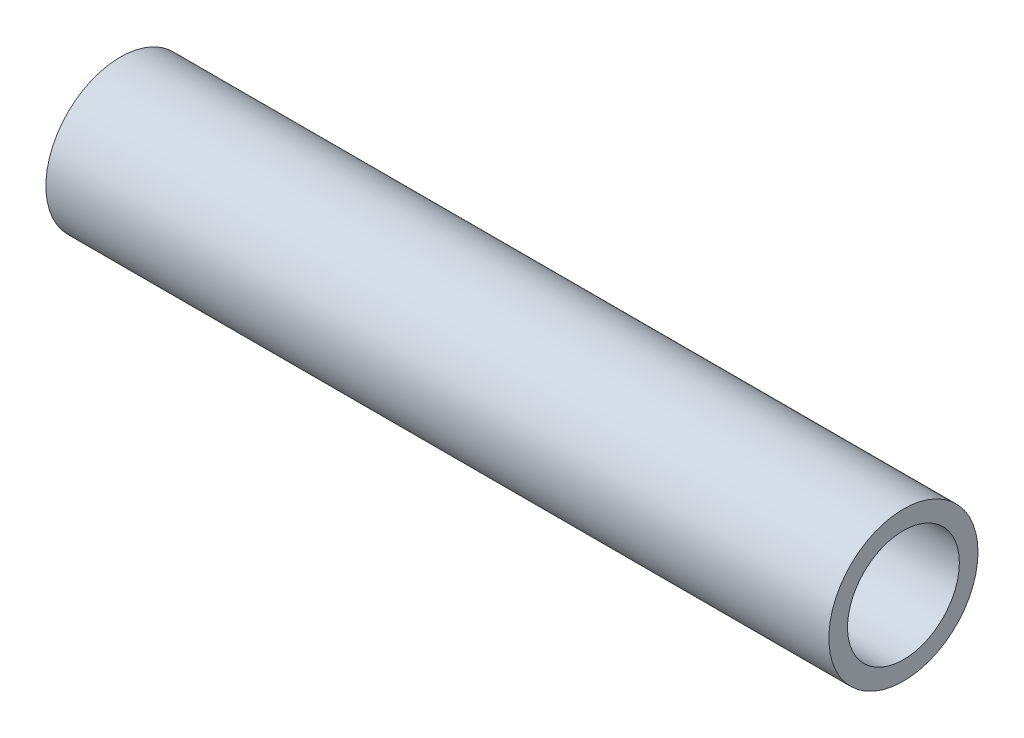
ISO-10303-21;
HEADER;
FILE_DESCRIPTION(('STEP AP214'),'2;1');
FILE_NAME('part.step','',(''),(''),'','','');
FILE_SCHEMA(('AUTOMOTIVE_DESIGN { 1 0 10303 214 1 1 1 1 }'));
ENDSEC;
DATA;
#1=APPLICATION_CONTEXT('core data for automotive mechanical design processes');
#2=APPLICATION_PROTOCOL_DEFINITION('international standard','automotive_design',2000,#1);
#3=PRODUCT_CONTEXT('',#1,'mechanical');
#4=PRODUCT('Part','Part','',(#3));
#5=PRODUCT_RELATED_PRODUCT_CATEGORY('part','',(#4));
#6=PRODUCT_DEFINITION_FORMATION('','',#4);
#7=PRODUCT_DEFINITION_CONTEXT('part definition',#1,'design');
#8=PRODUCT_DEFINITION('design','',#6,#7);
#9=PRODUCT_DEFINITION_SHAPE('','',#8);
#10=(LENGTH_UNIT() NAMED_UNIT(*) SI_UNIT(.MILLI.,.METRE.));
#11=(NAMED_UNIT(*) PLANE_ANGLE_UNIT() SI_UNIT($,.RADIAN.));
#12=(NAMED_UNIT(*) SI_UNIT($,.STERADIAN.) SOLID_ANGLE_UNIT());
#13=UNCERTAINTY_MEASURE_WITH_UNIT(LENGTH_MEASURE(1.E-05),#10,'distance_accuracy_value','');
#14=(GEOMETRIC_REPRESENTATION_CONTEXT(3) GLOBAL_UNCERTAINTY_ASSIGNED_CONTEXT((#13)) GLOBAL_UNIT_ASSIGNED_CONTEXT((#10,
#11,#12)) REPRESENTATION_CONTEXT('',''));
#15=CARTESIAN_POINT('',(0.,0.,0.));
#16=DIRECTION('',(0.,0.,1.));
#17=DIRECTION('',(1.,0.,0.));
#18=AXIS2_PLACEMENT_3D('',#15,#16,#17);
#19=CARTESIAN_POINT('',(0.,4.,0.));
#20=DIRECTION('',(1.,0.,0.));
#21=DIRECTION('',(0.,0.,-1.));
#22=AXIS2_PLACEMENT_3D('',#19,#20,#21);
#23=PLANE('',#22);
#24=CARTESIAN_POINT('',(0.,0.,0.));
#25=DIRECTION('',(1.,0.,0.));
#26=DIRECTION('',(0.,0.,-1.));
#27=AXIS2_PLACEMENT_3D('',#24,#25,#26);
#28=CIRCLE('',#27,4.);
#29=CARTESIAN_POINT('',(0.,0.,-4.));
#30=VERTEX_POINT('',#29);
#31=EDGE_CURVE('E46',#30,#30,#28,.T.);
#32=ORIENTED_EDGE('',*,*,#31,.T.);
#33=EDGE_LOOP('',(#32));
#34=FACE_BOUND('',#33,.T.);
#35=CARTESIAN_POINT('',(0.,0.,0.));
#36=DIRECTION('',(1.,0.,0.));
#37=DIRECTION('',(0.,0.,-1.));
#38=AXIS2_PLACEMENT_3D('',#35,#36,#37);
#39=CIRCLE('',#38,3.);
#40=CARTESIAN_POINT('',(0.,0.,-3.));
#41=VERTEX_POINT('',#40);
#42=EDGE_CURVE('E10',#41,#41,#39,.T.);
#43=ORIENTED_EDGE('',*,*,#42,.F.);
#44=EDGE_LOOP('',(#43));
#45=FACE_BOUND('',#44,.T.);
#46=ADVANCED_FACE('F32',(#34,#45),#23,.T.);
#47=CARTESIAN_POINT('',(0.,0.,0.));
#48=DIRECTION('',(1.,0.,0.));
#49=DIRECTION('',(0.,0.,-1.));
#50=AXIS2_PLACEMENT_3D('',#47,#48,#49);
#51=CYLINDRICAL_SURFACE('',#50,3.);
#52=ORIENTED_EDGE('',*,*,#42,.T.);
#53=EDGE_LOOP('',(#52));
#54=FACE_BOUND('',#53,.T.);
#55=CARTESIAN_POINT('',(-42.,0.,0.));
#56=DIRECTION('',(1.,0.,0.));
#57=DIRECTION('',(0.,0.,-1.));
#58=AXIS2_PLACEMENT_3D('',#55,#56,#57);
#59=CIRCLE('',#58,2.99999999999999);
#60=CARTESIAN_POINT('',(-42.,0.,-2.99999999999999));
#61=VERTEX_POINT('',#60);
#62=EDGE_CURVE('E38',#61,#61,#59,.T.);
#63=ORIENTED_EDGE('',*,*,#62,.F.);
#64=EDGE_LOOP('',(#63));
#65=FACE_BOUND('',#64,.T.);
#66=ADVANCED_FACE('F62',(#54,#65),#51,.F.);
#67=CARTESIAN_POINT('',(-42.,3.99999999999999,0.));
#68=DIRECTION('',(-1.,0.,0.));
#69=DIRECTION('',(0.,0.,1.));
#70=AXIS2_PLACEMENT_3D('',#67,#68,#69);
#71=PLANE('',#70);
#72=ORIENTED_EDGE('',*,*,#62,.T.);
#73=EDGE_LOOP('',(#72));
#74=FACE_BOUND('',#73,.T.);
#75=CARTESIAN_POINT('',(-42.,0.,0.));
#76=DIRECTION('',(1.,0.,0.));
#77=DIRECTION('',(0.,0.,-1.));
#78=AXIS2_PLACEMENT_3D('',#75,#76,#77);
#79=CIRCLE('',#78,3.99999999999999);
#80=CARTESIAN_POINT('',(-42.,0.,-3.99999999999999));
#81=VERTEX_POINT('',#80);
#82=EDGE_CURVE('E42',#81,#81,#79,.T.);
#83=ORIENTED_EDGE('',*,*,#82,.F.);
#84=EDGE_LOOP('',(#83));
#85=FACE_BOUND('',#84,.T.);
#86=ADVANCED_FACE('F56',(#74,#85),#71,.T.);
#87=CARTESIAN_POINT('',(0.,0.,0.));
#88=DIRECTION('',(1.,0.,0.));
#89=DIRECTION('',(0.,0.,-1.));
#90=AXIS2_PLACEMENT_3D('',#87,#88,#89);
#91=CYLINDRICAL_SURFACE('',#90,4.);
#92=ORIENTED_EDGE('',*,*,#82,.T.);
#93=EDGE_LOOP('',(#92));
#94=FACE_BOUND('',#93,.T.);
#95=ORIENTED_EDGE('',*,*,#31,.F.);
#96=EDGE_LOOP('',(#95));
#97=FACE_BOUND('',#96,.T.);
#98=ADVANCED_FACE('F54',(#94,#97),#91,.T.);
#99=CLOSED_SHELL('',(#46,#66,#86,#98));
#100=MANIFOLD_SOLID_BREP('B2',#99);
#101=ADVANCED_BREP_SHAPE_REPRESENTATION('',(#18,#100),#14);
#102=SHAPE_DEFINITION_REPRESENTATION(#9,#101);
ENDSEC;
END-ISO-10303-21;
